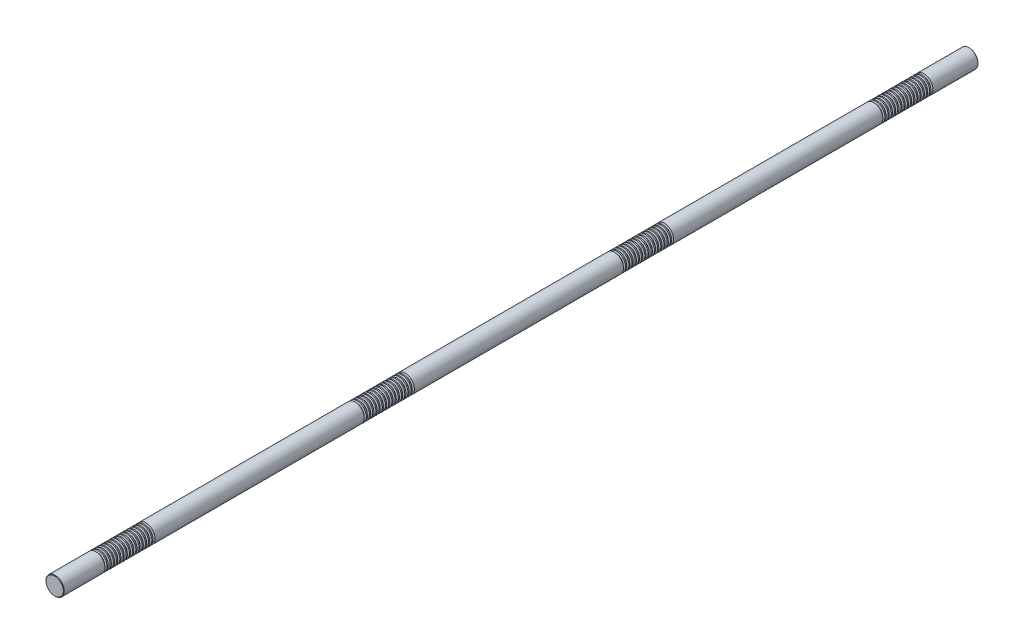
from build123d import *

# Parameters (mm, degrees)
SKETCH1_R           = 20
BOSS_EXTRUDE1_DEPTH = 1000
CHAMFER1_SIZE       = 1
LPATTERN1_COUNT     = 16
LPATTERN1_PITCH     = 7
LPATTERN2_COUNT     = 4
LPATTERN2_PITCH     = 567


with BuildPart() as part:
    # Sketch1 → Boss-Extrude1 (new, symmetric)
    with BuildSketch(Plane.XY):
        Circle(SKETCH1_R)
    extrude(amount=BOSS_EXTRUDE1_DEPTH, both=True)

    # Chamfer1
    chamfer1_edges = [part.edges().sort_by_distance(p)[0] for p in [
        (-20, 0, -1000),
        (-20, 0, 1000),
    ]]
    chamfer(chamfer1_edges, length=CHAMFER1_SIZE)

    # Sketch2 → Cut-Revolve1 (revolve, cut)
    with BuildSketch(Plane(origin=(0, 0, 0), x_dir=(0, 0, -1), z_dir=(1, 0, 0)), mode=Mode.PRIVATE) as cut_revolve1_sk:
        Polygon((900.535898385, 20), (895.964101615, 20), (897.035898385, 16), (899.464101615, 16), align=None)
    cut_revolve1 = revolve(cut_revolve1_sk.sketch.rotate(Axis((0, 0, 1000), (0, 0, -1)), 90), axis=Axis((0, 0, 1000), (0, 0, -1)), mode=Mode.SUBTRACT)

    # LPattern1: Cut-Revolve1 ×16
    with Locations(*[(0, 0, i * LPATTERN1_PITCH) for i in range(1, LPATTERN1_COUNT)]):
        add(cut_revolve1, mode=Mode.SUBTRACT)

    # LPattern2: Cut-Revolve1 ×4
    with Locations(*[(0, 0, i * LPATTERN2_PITCH) for i in range(1, LPATTERN2_COUNT)]):
        add(cut_revolve1, mode=Mode.SUBTRACT)

    # LPattern2 copy 1 sketch → LPattern2 copy 1 (revolve, cut)
    with BuildSketch(Plane(origin=(0, 0, 574), x_dir=(0, 0, -1), z_dir=(1, 0, 0))):
        Polygon((900.535898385, 20), (895.964101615, 20), (897.035898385, 16), (899.464101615, 16), align=None)
    revolve(axis=Axis((0, 0, 1574), (0, 0, -1)), mode=Mode.SUBTRACT)

    # LPattern2 copy 2 sketch → LPattern2 copy 2 (revolve, cut)
    with BuildSketch(Plane(origin=(0, 0, 1141), x_dir=(0, 0, -1), z_dir=(1, 0, 0))):
        Polygon((900.535898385, 20), (895.964101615, 20), (897.035898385, 16), (899.464101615, 16), align=None)
    revolve(axis=Axis((0, 0, 2141), (0, 0, -1)), mode=Mode.SUBTRACT)

    # LPattern2 copy 3 sketch → LPattern2 copy 3 (revolve, cut)
    with BuildSketch(Plane(origin=(0, 0, 1708), x_dir=(0, 0, -1), z_dir=(1, 0, 0))):
        Polygon((900.535898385, 20), (895.964101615, 20), (897.035898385, 16), (899.464101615, 16), align=None)
    revolve(axis=Axis((0, 0, 2708), (0, 0, -1)), mode=Mode.SUBTRACT)

    # LPattern2 copy 4 sketch → LPattern2 copy 4 (revolve, cut)
    with BuildSketch(Plane(origin=(0, 0, 581), x_dir=(0, 0, -1), z_dir=(1, 0, 0))):
        Polygon((900.535898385, 20), (895.964101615, 20), (897.035898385, 16), (899.464101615, 16), align=None)
    revolve(axis=Axis((0, 0, 1581), (0, 0, -1)), mode=Mode.SUBTRACT)

    # LPattern2 copy 5 sketch → LPattern2 copy 5 (revolve, cut)
    with BuildSketch(Plane(origin=(0, 0, 1148), x_dir=(0, 0, -1), z_dir=(1, 0, 0))):
        Polygon((900.535898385, 20), (895.964101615, 20), (897.035898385, 16), (899.464101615, 16), align=None)
    revolve(axis=Axis((0, 0, 2148), (0, 0, -1)), mode=Mode.SUBTRACT)

    # LPattern2 copy 6 sketch → LPattern2 copy 6 (revolve, cut)
    with BuildSketch(Plane(origin=(0, 0, 1715), x_dir=(0, 0, -1), z_dir=(1, 0, 0))):
        Polygon((900.535898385, 20), (895.964101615, 20), (897.035898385, 16), (899.464101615, 16), align=None)
    revolve(axis=Axis((0, 0, 2715), (0, 0, -1)), mode=Mode.SUBTRACT)

    # LPattern2 copy 7 sketch → LPattern2 copy 7 (revolve, cut)
    with BuildSketch(Plane(origin=(0, 0, 588), x_dir=(0, 0, -1), z_dir=(1, 0, 0))):
        Polygon((900.535898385, 20), (895.964101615, 20), (897.035898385, 16), (899.464101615, 16), align=None)
    revolve(axis=Axis((0, 0, 1588), (0, 0, -1)), mode=Mode.SUBTRACT)

    # LPattern2 copy 8 sketch → LPattern2 copy 8 (revolve, cut)
    with BuildSketch(Plane(origin=(0, 0, 1155), x_dir=(0, 0, -1), z_dir=(1, 0, 0))):
        Polygon((900.535898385, 20), (895.964101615, 20), (897.035898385, 16), (899.464101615, 16), align=None)
    revolve(axis=Axis((0, 0, 2155), (0, 0, -1)), mode=Mode.SUBTRACT)

    # LPattern2 copy 9 sketch → LPattern2 copy 9 (revolve, cut)
    with BuildSketch(Plane(origin=(0, 0, 1722), x_dir=(0, 0, -1), z_dir=(1, 0, 0))):
        Polygon((900.535898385, 20), (895.964101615, 20), (897.035898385, 16), (899.464101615, 16), align=None)
    revolve(axis=Axis((0, 0, 2722), (0, 0, -1)), mode=Mode.SUBTRACT)

    # LPattern2 copy 10 sketch → LPattern2 copy 10 (revolve, cut)
    with BuildSketch(Plane(origin=(0, 0, 595), x_dir=(0, 0, -1), z_dir=(1, 0, 0))):
        Polygon((900.535898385, 20), (895.964101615, 20), (897.035898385, 16), (899.464101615, 16), align=None)
    revolve(axis=Axis((0, 0, 1595), (0, 0, -1)), mode=Mode.SUBTRACT)

    # LPattern2 copy 11 sketch → LPattern2 copy 11 (revolve, cut)
    with BuildSketch(Plane(origin=(0, 0, 1162), x_dir=(0, 0, -1), z_dir=(1, 0, 0))):
        Polygon((900.535898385, 20), (895.964101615, 20), (897.035898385, 16), (899.464101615, 16), align=None)
    revolve(axis=Axis((0, 0, 2162), (0, 0, -1)), mode=Mode.SUBTRACT)

    # LPattern2 copy 12 sketch → LPattern2 copy 12 (revolve, cut)
    with BuildSketch(Plane(origin=(0, 0, 1729), x_dir=(0, 0, -1), z_dir=(1, 0, 0))):
        Polygon((900.535898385, 20), (895.964101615, 20), (897.035898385, 16), (899.464101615, 16), align=None)
    revolve(axis=Axis((0, 0, 2729), (0, 0, -1)), mode=Mode.SUBTRACT)

    # LPattern2 copy 13 sketch → LPattern2 copy 13 (revolve, cut)
    with BuildSketch(Plane(origin=(0, 0, 602), x_dir=(0, 0, -1), z_dir=(1, 0, 0))):
        Polygon((900.535898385, 20), (895.964101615, 20), (897.035898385, 16), (899.464101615, 16), align=None)
    revolve(axis=Axis((0, 0, 1602), (0, 0, -1)), mode=Mode.SUBTRACT)

    # LPattern2 copy 14 sketch → LPattern2 copy 14 (revolve, cut)
    with BuildSketch(Plane(origin=(0, 0, 1169), x_dir=(0, 0, -1), z_dir=(1, 0, 0))):
        Polygon((900.535898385, 20), (895.964101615, 20), (897.035898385, 16), (899.464101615, 16), align=None)
    revolve(axis=Axis((0, 0, 2169), (0, 0, -1)), mode=Mode.SUBTRACT)

    # LPattern2 copy 15 sketch → LPattern2 copy 15 (revolve, cut)
    with BuildSketch(Plane(origin=(0, 0, 1736), x_dir=(0, 0, -1), z_dir=(1, 0, 0))):
        Polygon((900.535898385, 20), (895.964101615, 20), (897.035898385, 16), (899.464101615, 16), align=None)
    revolve(axis=Axis((0, 0, 2736), (0, 0, -1)), mode=Mode.SUBTRACT)

    # LPattern2 copy 16 sketch → LPattern2 copy 16 (revolve, cut)
    with BuildSketch(Plane(origin=(0, 0, 609), x_dir=(0, 0, -1), z_dir=(1, 0, 0))):
        Polygon((900.535898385, 20), (895.964101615, 20), (897.035898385, 16), (899.464101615, 16), align=None)
    revolve(axis=Axis((0, 0, 1609), (0, 0, -1)), mode=Mode.SUBTRACT)

    # LPattern2 copy 17 sketch → LPattern2 copy 17 (revolve, cut)
    with BuildSketch(Plane(origin=(0, 0, 1176), x_dir=(0, 0, -1), z_dir=(1, 0, 0))):
        Polygon((900.535898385, 20), (895.964101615, 20), (897.035898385, 16), (899.464101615, 16), align=None)
    revolve(axis=Axis((0, 0, 2176), (0, 0, -1)), mode=Mode.SUBTRACT)

    # LPattern2 copy 18 sketch → LPattern2 copy 18 (revolve, cut)
    with BuildSketch(Plane(origin=(0, 0, 1743), x_dir=(0, 0, -1), z_dir=(1, 0, 0))):
        Polygon((900.535898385, 20), (895.964101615, 20), (897.035898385, 16), (899.464101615, 16), align=None)
    revolve(axis=Axis((0, 0, 2743), (0, 0, -1)), mode=Mode.SUBTRACT)

    # LPattern2 copy 19 sketch → LPattern2 copy 19 (revolve, cut)
    with BuildSketch(Plane(origin=(0, 0, 616), x_dir=(0, 0, -1), z_dir=(1, 0, 0))):
        Polygon((900.535898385, 20), (895.964101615, 20), (897.035898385, 16), (899.464101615, 16), align=None)
    revolve(axis=Axis((0, 0, 1616), (0, 0, -1)), mode=Mode.SUBTRACT)

    # LPattern2 copy 20 sketch → LPattern2 copy 20 (revolve, cut)
    with BuildSketch(Plane(origin=(0, 0, 1183), x_dir=(0, 0, -1), z_dir=(1, 0, 0))):
        Polygon((900.535898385, 20), (895.964101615, 20), (897.035898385, 16), (899.464101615, 16), align=None)
    revolve(axis=Axis((0, 0, 2183), (0, 0, -1)), mode=Mode.SUBTRACT)

    # LPattern2 copy 21 sketch → LPattern2 copy 21 (revolve, cut)
    with BuildSketch(Plane(origin=(0, 0, 1750), x_dir=(0, 0, -1), z_dir=(1, 0, 0))):
        Polygon((900.535898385, 20), (895.964101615, 20), (897.035898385, 16), (899.464101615, 16), align=None)
    revolve(axis=Axis((0, 0, 2750), (0, 0, -1)), mode=Mode.SUBTRACT)

    # LPattern2 copy 22 sketch → LPattern2 copy 22 (revolve, cut)
    with BuildSketch(Plane(origin=(0, 0, 623), x_dir=(0, 0, -1), z_dir=(1, 0, 0))):
        Polygon((900.535898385, 20), (895.964101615, 20), (897.035898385, 16), (899.464101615, 16), align=None)
    revolve(axis=Axis((0, 0, 1623), (0, 0, -1)), mode=Mode.SUBTRACT)

    # LPattern2 copy 23 sketch → LPattern2 copy 23 (revolve, cut)
    with BuildSketch(Plane(origin=(0, 0, 1190), x_dir=(0, 0, -1), z_dir=(1, 0, 0))):
        Polygon((900.535898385, 20), (895.964101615, 20), (897.035898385, 16), (899.464101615, 16), align=None)
    revolve(axis=Axis((0, 0, 2190), (0, 0, -1)), mode=Mode.SUBTRACT)

    # LPattern2 copy 24 sketch → LPattern2 copy 24 (revolve, cut)
    with BuildSketch(Plane(origin=(0, 0, 1757), x_dir=(0, 0, -1), z_dir=(1, 0, 0))):
        Polygon((900.535898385, 20), (895.964101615, 20), (897.035898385, 16), (899.464101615, 16), align=None)
    revolve(axis=Axis((0, 0, 2757), (0, 0, -1)), mode=Mode.SUBTRACT)

    # LPattern2 copy 25 sketch → LPattern2 copy 25 (revolve, cut)
    with BuildSketch(Plane(origin=(0, 0, 630), x_dir=(0, 0, -1), z_dir=(1, 0, 0))):
        Polygon((900.535898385, 20), (895.964101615, 20), (897.035898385, 16), (899.464101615, 16), align=None)
    revolve(axis=Axis((0, 0, 1630), (0, 0, -1)), mode=Mode.SUBTRACT)

    # LPattern2 copy 26 sketch → LPattern2 copy 26 (revolve, cut)
    with BuildSketch(Plane(origin=(0, 0, 1197), x_dir=(0, 0, -1), z_dir=(1, 0, 0))):
        Polygon((900.535898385, 20), (895.964101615, 20), (897.035898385, 16), (899.464101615, 16), align=None)
    revolve(axis=Axis((0, 0, 2197), (0, 0, -1)), mode=Mode.SUBTRACT)

    # LPattern2 copy 27 sketch → LPattern2 copy 27 (revolve, cut)
    with BuildSketch(Plane(origin=(0, 0, 1764), x_dir=(0, 0, -1), z_dir=(1, 0, 0))):
        Polygon((900.535898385, 20), (895.964101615, 20), (897.035898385, 16), (899.464101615, 16), align=None)
    revolve(axis=Axis((0, 0, 2764), (0, 0, -1)), mode=Mode.SUBTRACT)

    # LPattern2 copy 28 sketch → LPattern2 copy 28 (revolve, cut)
    with BuildSketch(Plane(origin=(0, 0, 637), x_dir=(0, 0, -1), z_dir=(1, 0, 0))):
        Polygon((900.535898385, 20), (895.964101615, 20), (897.035898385, 16), (899.464101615, 16), align=None)
    revolve(axis=Axis((0, 0, 1637), (0, 0, -1)), mode=Mode.SUBTRACT)

    # LPattern2 copy 29 sketch → LPattern2 copy 29 (revolve, cut)
    with BuildSketch(Plane(origin=(0, 0, 1204), x_dir=(0, 0, -1), z_dir=(1, 0, 0))):
        Polygon((900.535898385, 20), (895.964101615, 20), (897.035898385, 16), (899.464101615, 16), align=None)
    revolve(axis=Axis((0, 0, 2204), (0, 0, -1)), mode=Mode.SUBTRACT)

    # LPattern2 copy 30 sketch → LPattern2 copy 30 (revolve, cut)
    with BuildSketch(Plane(origin=(0, 0, 1771), x_dir=(0, 0, -1), z_dir=(1, 0, 0))):
        Polygon((900.535898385, 20), (895.964101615, 20), (897.035898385, 16), (899.464101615, 16), align=None)
    revolve(axis=Axis((0, 0, 2771), (0, 0, -1)), mode=Mode.SUBTRACT)

    # LPattern2 copy 31 sketch → LPattern2 copy 31 (revolve, cut)
    with BuildSketch(Plane(origin=(0, 0, 644), x_dir=(0, 0, -1), z_dir=(1, 0, 0))):
        Polygon((900.535898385, 20), (895.964101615, 20), (897.035898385, 16), (899.464101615, 16), align=None)
    revolve(axis=Axis((0, 0, 1644), (0, 0, -1)), mode=Mode.SUBTRACT)

    # LPattern2 copy 32 sketch → LPattern2 copy 32 (revolve, cut)
    with BuildSketch(Plane(origin=(0, 0, 1211), x_dir=(0, 0, -1), z_dir=(1, 0, 0))):
        Polygon((900.535898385, 20), (895.964101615, 20), (897.035898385, 16), (899.464101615, 16), align=None)
    revolve(axis=Axis((0, 0, 2211), (0, 0, -1)), mode=Mode.SUBTRACT)

    # LPattern2 copy 33 sketch → LPattern2 copy 33 (revolve, cut)
    with BuildSketch(Plane(origin=(0, 0, 1778), x_dir=(0, 0, -1), z_dir=(1, 0, 0))):
        Polygon((900.535898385, 20), (895.964101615, 20), (897.035898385, 16), (899.464101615, 16), align=None)
    revolve(axis=Axis((0, 0, 2778), (0, 0, -1)), mode=Mode.SUBTRACT)

    # LPattern2 copy 34 sketch → LPattern2 copy 34 (revolve, cut)
    with BuildSketch(Plane(origin=(0, 0, 651), x_dir=(0, 0, -1), z_dir=(1, 0, 0))):
        Polygon((900.535898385, 20), (895.964101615, 20), (897.035898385, 16), (899.464101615, 16), align=None)
    revolve(axis=Axis((0, 0, 1651), (0, 0, -1)), mode=Mode.SUBTRACT)

    # LPattern2 copy 35 sketch → LPattern2 copy 35 (revolve, cut)
    with BuildSketch(Plane(origin=(0, 0, 1218), x_dir=(0, 0, -1), z_dir=(1, 0, 0))):
        Polygon((900.535898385, 20), (895.964101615, 20), (897.035898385, 16), (899.464101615, 16), align=None)
    revolve(axis=Axis((0, 0, 2218), (0, 0, -1)), mode=Mode.SUBTRACT)

    # LPattern2 copy 36 sketch → LPattern2 copy 36 (revolve, cut)
    with BuildSketch(Plane(origin=(0, 0, 1785), x_dir=(0, 0, -1), z_dir=(1, 0, 0))):
        Polygon((900.535898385, 20), (895.964101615, 20), (897.035898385, 16), (899.464101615, 16), align=None)
    revolve(axis=Axis((0, 0, 2785), (0, 0, -1)), mode=Mode.SUBTRACT)

    # LPattern2 copy 37 sketch → LPattern2 copy 37 (revolve, cut)
    with BuildSketch(Plane(origin=(0, 0, 658), x_dir=(0, 0, -1), z_dir=(1, 0, 0))):
        Polygon((900.535898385, 20), (895.964101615, 20), (897.035898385, 16), (899.464101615, 16), align=None)
    revolve(axis=Axis((0, 0, 1658), (0, 0, -1)), mode=Mode.SUBTRACT)

    # LPattern2 copy 38 sketch → LPattern2 copy 38 (revolve, cut)
    with BuildSketch(Plane(origin=(0, 0, 1225), x_dir=(0, 0, -1), z_dir=(1, 0, 0))):
        Polygon((900.535898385, 20), (895.964101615, 20), (897.035898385, 16), (899.464101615, 16), align=None)
    revolve(axis=Axis((0, 0, 2225), (0, 0, -1)), mode=Mode.SUBTRACT)

    # LPattern2 copy 39 sketch → LPattern2 copy 39 (revolve, cut)
    with BuildSketch(Plane(origin=(0, 0, 1792), x_dir=(0, 0, -1), z_dir=(1, 0, 0))):
        Polygon((900.535898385, 20), (895.964101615, 20), (897.035898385, 16), (899.464101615, 16), align=None)
    revolve(axis=Axis((0, 0, 2792), (0, 0, -1)), mode=Mode.SUBTRACT)

    # LPattern2 copy 40 sketch → LPattern2 copy 40 (revolve, cut)
    with BuildSketch(Plane(origin=(0, 0, 665), x_dir=(0, 0, -1), z_dir=(1, 0, 0))):
        Polygon((900.535898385, 20), (895.964101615, 20), (897.035898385, 16), (899.464101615, 16), align=None)
    revolve(axis=Axis((0, 0, 1665), (0, 0, -1)), mode=Mode.SUBTRACT)

    # LPattern2 copy 41 sketch → LPattern2 copy 41 (revolve, cut)
    with BuildSketch(Plane(origin=(0, 0, 1232), x_dir=(0, 0, -1), z_dir=(1, 0, 0))):
        Polygon((900.535898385, 20), (895.964101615, 20), (897.035898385, 16), (899.464101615, 16), align=None)
    revolve(axis=Axis((0, 0, 2232), (0, 0, -1)), mode=Mode.SUBTRACT)

    # LPattern2 copy 42 sketch → LPattern2 copy 42 (revolve, cut)
    with BuildSketch(Plane(origin=(0, 0, 1799), x_dir=(0, 0, -1), z_dir=(1, 0, 0))):
        Polygon((900.535898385, 20), (895.964101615, 20), (897.035898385, 16), (899.464101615, 16), align=None)
    revolve(axis=Axis((0, 0, 2799), (0, 0, -1)), mode=Mode.SUBTRACT)

    # LPattern2 copy 43 sketch → LPattern2 copy 43 (revolve, cut)
    with BuildSketch(Plane(origin=(0, 0, 672), x_dir=(0, 0, -1), z_dir=(1, 0, 0))):
        Polygon((900.535898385, 20), (895.964101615, 20), (897.035898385, 16), (899.464101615, 16), align=None)
    revolve(axis=Axis((0, 0, 1672), (0, 0, -1)), mode=Mode.SUBTRACT)

    # LPattern2 copy 44 sketch → LPattern2 copy 44 (revolve, cut)
    with BuildSketch(Plane(origin=(0, 0, 1239), x_dir=(0, 0, -1), z_dir=(1, 0, 0))):
        Polygon((900.535898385, 20), (895.964101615, 20), (897.035898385, 16), (899.464101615, 16), align=None)
    revolve(axis=Axis((0, 0, 2239), (0, 0, -1)), mode=Mode.SUBTRACT)

    # LPattern2 copy 45 sketch → LPattern2 copy 45 (revolve, cut)
    with BuildSketch(Plane(origin=(0, 0, 1806), x_dir=(0, 0, -1), z_dir=(1, 0, 0))):
        Polygon((900.535898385, 20), (895.964101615, 20), (897.035898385, 16), (899.464101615, 16), align=None)
    revolve(axis=Axis((0, 0, 2806), (0, 0, -1)), mode=Mode.SUBTRACT)


solid = part.part
